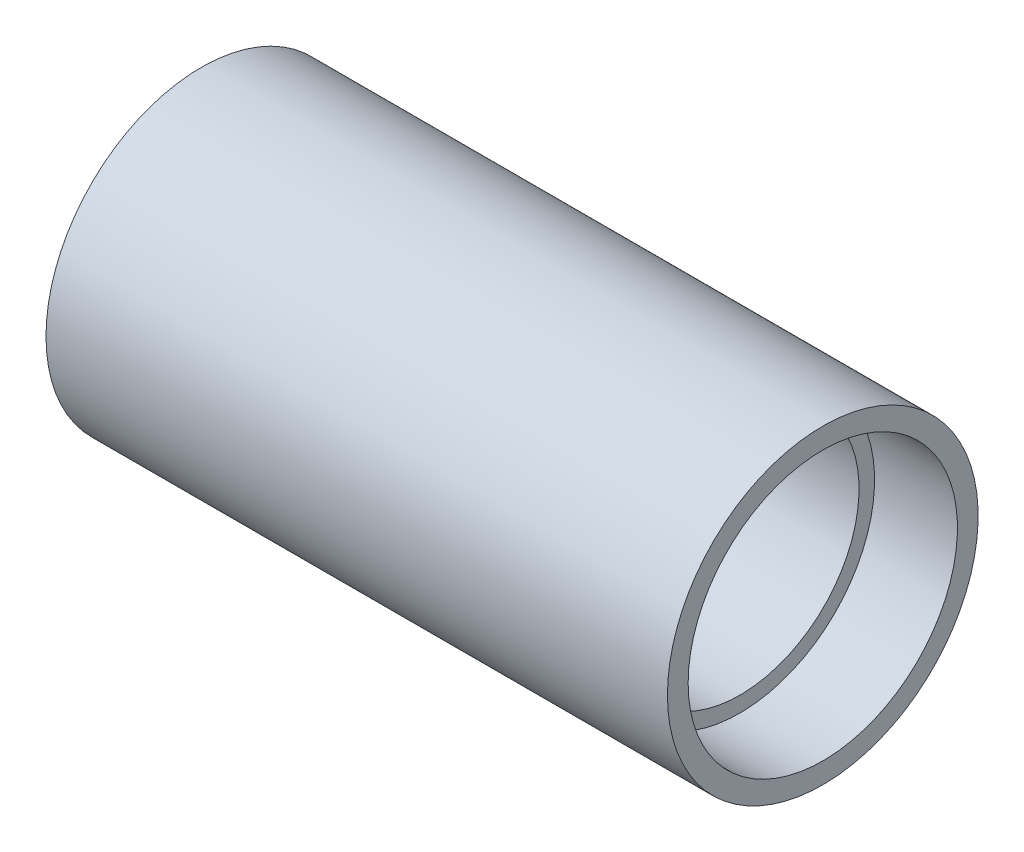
ISO-10303-21;
HEADER;
FILE_DESCRIPTION(('STEP AP214'),'2;1');
FILE_NAME('part.step','',(''),(''),'','','');
FILE_SCHEMA(('AUTOMOTIVE_DESIGN { 1 0 10303 214 1 1 1 1 }'));
ENDSEC;
DATA;
#1=APPLICATION_CONTEXT('core data for automotive mechanical design processes');
#2=APPLICATION_PROTOCOL_DEFINITION('international standard','automotive_design',2000,#1);
#3=PRODUCT_CONTEXT('',#1,'mechanical');
#4=PRODUCT('Part','Part','',(#3));
#5=PRODUCT_RELATED_PRODUCT_CATEGORY('part','',(#4));
#6=PRODUCT_DEFINITION_FORMATION('','',#4);
#7=PRODUCT_DEFINITION_CONTEXT('part definition',#1,'design');
#8=PRODUCT_DEFINITION('design','',#6,#7);
#9=PRODUCT_DEFINITION_SHAPE('','',#8);
#10=(LENGTH_UNIT() NAMED_UNIT(*) SI_UNIT(.MILLI.,.METRE.));
#11=(NAMED_UNIT(*) PLANE_ANGLE_UNIT() SI_UNIT($,.RADIAN.));
#12=(NAMED_UNIT(*) SI_UNIT($,.STERADIAN.) SOLID_ANGLE_UNIT());
#13=UNCERTAINTY_MEASURE_WITH_UNIT(LENGTH_MEASURE(1.E-05),#10,'distance_accuracy_value','');
#14=(GEOMETRIC_REPRESENTATION_CONTEXT(3) GLOBAL_UNCERTAINTY_ASSIGNED_CONTEXT((#13)) GLOBAL_UNIT_ASSIGNED_CONTEXT((#10,
#11,#12)) REPRESENTATION_CONTEXT('',''));
#15=CARTESIAN_POINT('',(0.,0.,0.));
#16=DIRECTION('',(0.,0.,1.));
#17=DIRECTION('',(1.,0.,0.));
#18=AXIS2_PLACEMENT_3D('',#15,#16,#17);
#19=CARTESIAN_POINT('',(-4.21723976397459,0.,0.));
#20=DIRECTION('',(-1.,0.,0.));
#21=DIRECTION('',(0.,0.,1.));
#22=AXIS2_PLACEMENT_3D('',#19,#20,#21);
#23=CYLINDRICAL_SURFACE('',#22,15.);
#24=CARTESIAN_POINT('',(0.,0.,0.));
#25=DIRECTION('',(-1.,0.,0.));
#26=DIRECTION('',(0.,0.,1.));
#27=AXIS2_PLACEMENT_3D('',#24,#25,#26);
#28=CIRCLE('',#27,15.);
#29=CARTESIAN_POINT('',(0.,0.,15.));
#30=VERTEX_POINT('',#29);
#31=EDGE_CURVE('E56',#30,#30,#28,.T.);
#32=ORIENTED_EDGE('',*,*,#31,.F.);
#33=EDGE_LOOP('',(#32));
#34=FACE_BOUND('',#33,.T.);
#35=CARTESIAN_POINT('',(60.0000000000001,0.,0.));
#36=DIRECTION('',(-1.,0.,0.));
#37=DIRECTION('',(0.,0.,1.));
#38=AXIS2_PLACEMENT_3D('',#35,#36,#37);
#39=CIRCLE('',#38,15.);
#40=CARTESIAN_POINT('',(60.0000000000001,0.,15.));
#41=VERTEX_POINT('',#40);
#42=EDGE_CURVE('E10',#41,#41,#39,.T.);
#43=ORIENTED_EDGE('',*,*,#42,.T.);
#44=EDGE_LOOP('',(#43));
#45=FACE_BOUND('',#44,.T.);
#46=ADVANCED_FACE('F28',(#34,#45),#23,.T.);
#47=CARTESIAN_POINT('',(60.,15.0000000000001,0.));
#48=DIRECTION('',(-1.,0.,0.));
#49=DIRECTION('',(0.,0.,1.));
#50=AXIS2_PLACEMENT_3D('',#47,#48,#49);
#51=PLANE('',#50);
#52=ORIENTED_EDGE('',*,*,#42,.F.);
#53=EDGE_LOOP('',(#52));
#54=FACE_BOUND('',#53,.T.);
#55=CARTESIAN_POINT('',(60.0000000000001,0.,0.));
#56=DIRECTION('',(-1.,0.,0.));
#57=DIRECTION('',(0.,0.,1.));
#58=AXIS2_PLACEMENT_3D('',#55,#56,#57);
#59=CIRCLE('',#58,13.);
#60=CARTESIAN_POINT('',(60.0000000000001,0.,13.));
#61=VERTEX_POINT('',#60);
#62=EDGE_CURVE('E34',#61,#61,#59,.T.);
#63=ORIENTED_EDGE('',*,*,#62,.T.);
#64=EDGE_LOOP('',(#63));
#65=FACE_BOUND('',#64,.T.);
#66=ADVANCED_FACE('F63',(#54,#65),#51,.F.);
#67=CARTESIAN_POINT('',(-4.21723976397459,0.,0.));
#68=DIRECTION('',(-1.,0.,0.));
#69=DIRECTION('',(0.,0.,1.));
#70=AXIS2_PLACEMENT_3D('',#67,#68,#69);
#71=CYLINDRICAL_SURFACE('',#70,13.);
#72=ORIENTED_EDGE('',*,*,#62,.F.);
#73=EDGE_LOOP('',(#72));
#74=FACE_BOUND('',#73,.T.);
#75=CARTESIAN_POINT('',(52.0000000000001,0.,0.));
#76=DIRECTION('',(-1.,0.,0.));
#77=DIRECTION('',(0.,0.,1.));
#78=AXIS2_PLACEMENT_3D('',#75,#76,#77);
#79=CIRCLE('',#78,13.);
#80=CARTESIAN_POINT('',(52.0000000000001,0.,13.));
#81=VERTEX_POINT('',#80);
#82=EDGE_CURVE('E38',#81,#81,#79,.T.);
#83=ORIENTED_EDGE('',*,*,#82,.T.);
#84=EDGE_LOOP('',(#83));
#85=FACE_BOUND('',#84,.T.);
#86=ADVANCED_FACE('F67',(#74,#85),#71,.F.);
#87=CARTESIAN_POINT('',(52.,13.,0.));
#88=DIRECTION('',(-1.,0.,0.));
#89=DIRECTION('',(0.,0.,1.));
#90=AXIS2_PLACEMENT_3D('',#87,#88,#89);
#91=PLANE('',#90);
#92=ORIENTED_EDGE('',*,*,#82,.F.);
#93=EDGE_LOOP('',(#92));
#94=FACE_BOUND('',#93,.T.);
#95=CARTESIAN_POINT('',(52.0000000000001,0.,0.));
#96=DIRECTION('',(-1.,0.,0.));
#97=DIRECTION('',(0.,0.,1.));
#98=AXIS2_PLACEMENT_3D('',#95,#96,#97);
#99=CIRCLE('',#98,11.5);
#100=CARTESIAN_POINT('',(52.0000000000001,0.,11.5));
#101=VERTEX_POINT('',#100);
#102=EDGE_CURVE('E42',#101,#101,#99,.T.);
#103=ORIENTED_EDGE('',*,*,#102,.T.);
#104=EDGE_LOOP('',(#103));
#105=FACE_BOUND('',#104,.T.);
#106=ADVANCED_FACE('F72',(#94,#105),#91,.F.);
#107=CARTESIAN_POINT('',(-4.21723976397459,0.,0.));
#108=DIRECTION('',(-1.,0.,0.));
#109=DIRECTION('',(0.,0.,1.));
#110=AXIS2_PLACEMENT_3D('',#107,#108,#109);
#111=CYLINDRICAL_SURFACE('',#110,11.5);
#112=ORIENTED_EDGE('',*,*,#102,.F.);
#113=EDGE_LOOP('',(#112));
#114=FACE_BOUND('',#113,.T.);
#115=CARTESIAN_POINT('',(7.99999999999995,0.,0.));
#116=DIRECTION('',(-1.,0.,0.));
#117=DIRECTION('',(0.,0.,1.));
#118=AXIS2_PLACEMENT_3D('',#115,#116,#117);
#119=CIRCLE('',#118,11.5);
#120=CARTESIAN_POINT('',(7.99999999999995,0.,11.5));
#121=VERTEX_POINT('',#120);
#122=EDGE_CURVE('E47',#121,#121,#119,.T.);
#123=ORIENTED_EDGE('',*,*,#122,.T.);
#124=EDGE_LOOP('',(#123));
#125=FACE_BOUND('',#124,.T.);
#126=ADVANCED_FACE('F78',(#114,#125),#111,.F.);
#127=CARTESIAN_POINT('',(8.00000000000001,11.5,0.));
#128=DIRECTION('',(1.,0.,0.));
#129=DIRECTION('',(0.,0.,-1.));
#130=AXIS2_PLACEMENT_3D('',#127,#128,#129);
#131=PLANE('',#130);
#132=ORIENTED_EDGE('',*,*,#122,.F.);
#133=EDGE_LOOP('',(#132));
#134=FACE_BOUND('',#133,.T.);
#135=CARTESIAN_POINT('',(7.99999999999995,0.,0.));
#136=DIRECTION('',(-1.,0.,0.));
#137=DIRECTION('',(0.,0.,1.));
#138=AXIS2_PLACEMENT_3D('',#135,#136,#137);
#139=CIRCLE('',#138,13.);
#140=CARTESIAN_POINT('',(7.99999999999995,0.,13.));
#141=VERTEX_POINT('',#140);
#142=EDGE_CURVE('E50',#141,#141,#139,.T.);
#143=ORIENTED_EDGE('',*,*,#142,.T.);
#144=EDGE_LOOP('',(#143));
#145=FACE_BOUND('',#144,.T.);
#146=ADVANCED_FACE('F82',(#134,#145),#131,.F.);
#147=CARTESIAN_POINT('',(-4.21723976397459,0.,0.));
#148=DIRECTION('',(-1.,0.,0.));
#149=DIRECTION('',(0.,0.,1.));
#150=AXIS2_PLACEMENT_3D('',#147,#148,#149);
#151=CYLINDRICAL_SURFACE('',#150,13.);
#152=ORIENTED_EDGE('',*,*,#142,.F.);
#153=EDGE_LOOP('',(#152));
#154=FACE_BOUND('',#153,.T.);
#155=CARTESIAN_POINT('',(0.,0.,0.));
#156=DIRECTION('',(-1.,0.,0.));
#157=DIRECTION('',(0.,0.,1.));
#158=AXIS2_PLACEMENT_3D('',#155,#156,#157);
#159=CIRCLE('',#158,13.);
#160=CARTESIAN_POINT('',(0.,0.,13.));
#161=VERTEX_POINT('',#160);
#162=EDGE_CURVE('E53',#161,#161,#159,.T.);
#163=ORIENTED_EDGE('',*,*,#162,.T.);
#164=EDGE_LOOP('',(#163));
#165=FACE_BOUND('',#164,.T.);
#166=ADVANCED_FACE('F86',(#154,#165),#151,.F.);
#167=CARTESIAN_POINT('',(0.,13.,0.));
#168=DIRECTION('',(1.,0.,0.));
#169=DIRECTION('',(0.,0.,-1.));
#170=AXIS2_PLACEMENT_3D('',#167,#168,#169);
#171=PLANE('',#170);
#172=ORIENTED_EDGE('',*,*,#162,.F.);
#173=EDGE_LOOP('',(#172));
#174=FACE_BOUND('',#173,.T.);
#175=ORIENTED_EDGE('',*,*,#31,.T.);
#176=EDGE_LOOP('',(#175));
#177=FACE_BOUND('',#176,.T.);
#178=ADVANCED_FACE('F60',(#174,#177),#171,.F.);
#179=CLOSED_SHELL('',(#46,#66,#86,#106,#126,#146,#166,#178));
#180=MANIFOLD_SOLID_BREP('B2',#179);
#181=ADVANCED_BREP_SHAPE_REPRESENTATION('',(#18,#180),#14);
#182=SHAPE_DEFINITION_REPRESENTATION(#9,#181);
ENDSEC;
END-ISO-10303-21;
